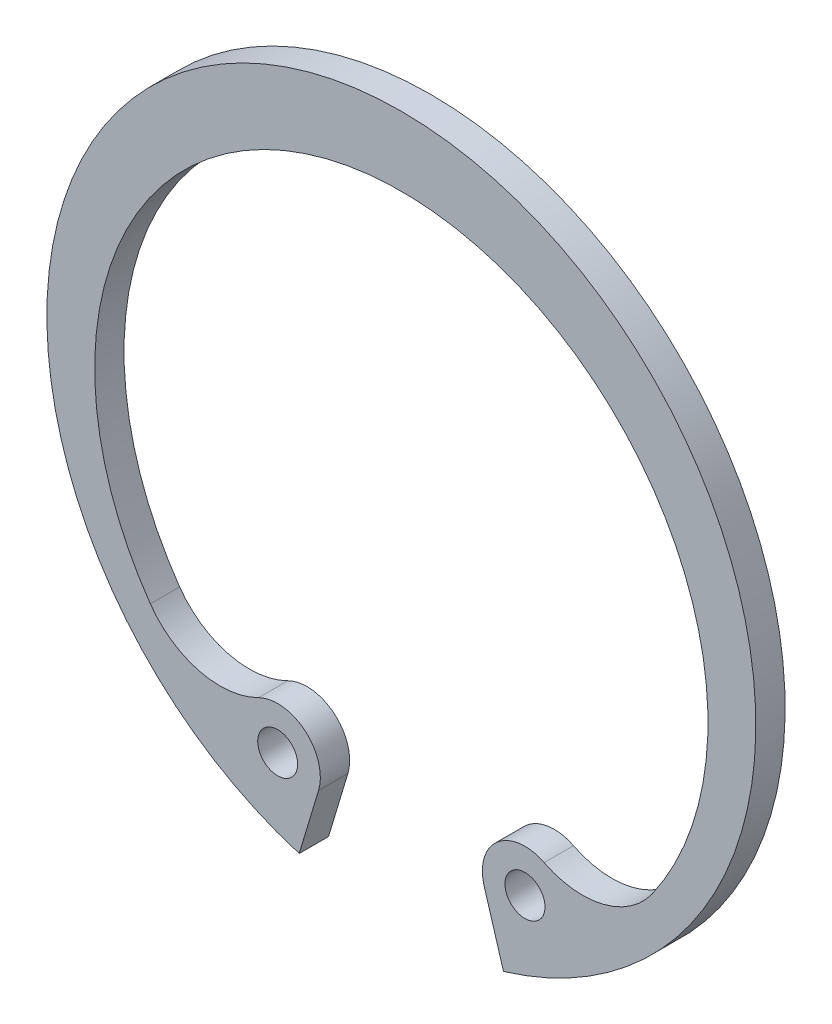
from build123d import *

# Parameters (mm, degrees)
BODYSKE_R  = 0.75
BODY_DEPTH = 1.1


with BuildPart() as part:
    # BodySke → Body (new body)
    with BuildSketch(Plane.XY):
        with BuildLine():
            Line((3.832592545, -12.735824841), (3.106973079, -10.324568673))
            ThreePointArc((3.106973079, -10.324568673), (3.610557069, -8.637905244), (5.359014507, -8.434614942))
            ThreePointArc((5.359014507, -8.434614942), (7.578434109, -8.680418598), (9.418239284, -7.414970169))
            ThreePointArc((9.418239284, -7.414970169), (0, 10.7), (-9.418239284, -7.414970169))
            ThreePointArc((-9.418239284, -7.414970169), (-7.578434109, -8.680418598), (-5.359014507, -8.434614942))
            ThreePointArc((-5.359014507, -8.434614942), (-3.610557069, -8.637905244), (-3.106973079, -10.324568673))
            Line((-3.106973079, -10.324568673), (-3.832592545, -12.735824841))
            ThreePointArc((-3.832592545, -12.735824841), (0, 13.3), (3.832592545, -12.735824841))
        make_face()
        with Locations((4.639102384, -9.863504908)):
            Circle(BODYSKE_R, mode=Mode.SUBTRACT)
        with Locations((-4.639102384, -9.863504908)):
            Circle(BODYSKE_R, mode=Mode.SUBTRACT)
    extrude(amount=-BODY_DEPTH)


solid = part.part
